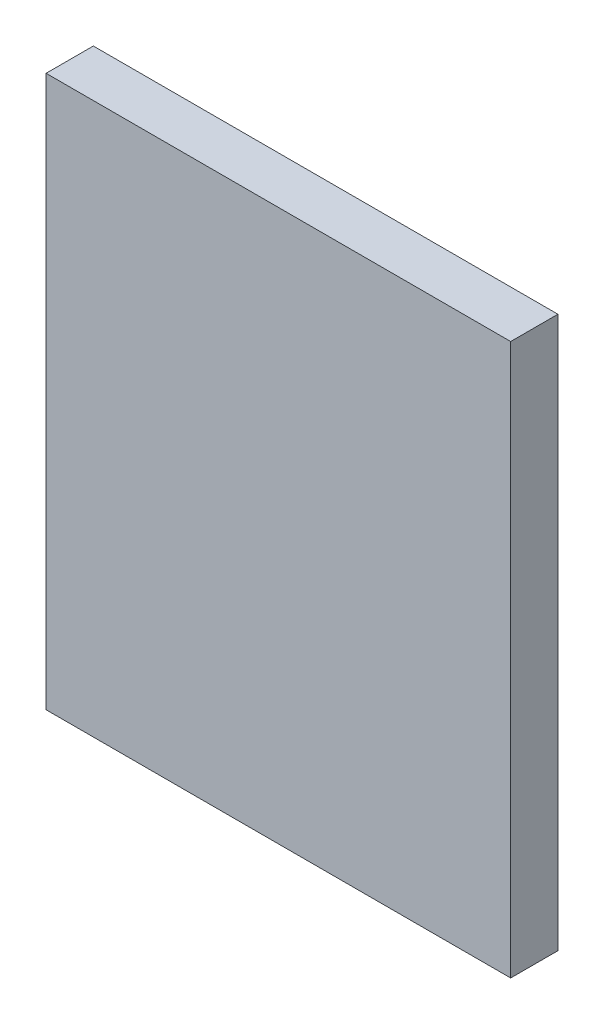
ISO-10303-21;
HEADER;
FILE_DESCRIPTION(('STEP AP214'),'2;1');
FILE_NAME('part.step','',(''),(''),'','','');
FILE_SCHEMA(('AUTOMOTIVE_DESIGN { 1 0 10303 214 1 1 1 1 }'));
ENDSEC;
DATA;
#1=APPLICATION_CONTEXT('core data for automotive mechanical design processes');
#2=APPLICATION_PROTOCOL_DEFINITION('international standard','automotive_design',2000,#1);
#3=PRODUCT_CONTEXT('',#1,'mechanical');
#4=PRODUCT('Part','Part','',(#3));
#5=PRODUCT_RELATED_PRODUCT_CATEGORY('part','',(#4));
#6=PRODUCT_DEFINITION_FORMATION('','',#4);
#7=PRODUCT_DEFINITION_CONTEXT('part definition',#1,'design');
#8=PRODUCT_DEFINITION('design','',#6,#7);
#9=PRODUCT_DEFINITION_SHAPE('','',#8);
#10=(LENGTH_UNIT() NAMED_UNIT(*) SI_UNIT(.MILLI.,.METRE.));
#11=(NAMED_UNIT(*) PLANE_ANGLE_UNIT() SI_UNIT($,.RADIAN.));
#12=(NAMED_UNIT(*) SI_UNIT($,.STERADIAN.) SOLID_ANGLE_UNIT());
#13=UNCERTAINTY_MEASURE_WITH_UNIT(LENGTH_MEASURE(1.E-05),#10,'distance_accuracy_value','');
#14=(GEOMETRIC_REPRESENTATION_CONTEXT(3) GLOBAL_UNCERTAINTY_ASSIGNED_CONTEXT((#13)) GLOBAL_UNIT_ASSIGNED_CONTEXT((#10,
#11,#12)) REPRESENTATION_CONTEXT('',''));
#15=CARTESIAN_POINT('',(0.,0.,0.));
#16=DIRECTION('',(0.,0.,1.));
#17=DIRECTION('',(1.,0.,0.));
#18=AXIS2_PLACEMENT_3D('',#15,#16,#17);
#19=CARTESIAN_POINT('',(14.75,17.5,3.));
#20=DIRECTION('',(-1.,0.,0.));
#21=DIRECTION('',(0.,-1.,0.));
#22=AXIS2_PLACEMENT_3D('',#19,#20,#21);
#23=PLANE('',#22);
#24=DIRECTION('',(0.,1.,0.));
#25=VECTOR('',#24,1.);
#26=CARTESIAN_POINT('',(14.75,17.5,0.));
#27=LINE('',#26,#25);
#28=CARTESIAN_POINT('',(14.75,-17.5,0.));
#29=VERTEX_POINT('',#28);
#30=CARTESIAN_POINT('',(14.75,17.5,0.));
#31=VERTEX_POINT('',#30);
#32=EDGE_CURVE('E96',#29,#31,#27,.T.);
#33=ORIENTED_EDGE('',*,*,#32,.T.);
#34=DIRECTION('',(0.,0.,-1.));
#35=VECTOR('',#34,1.);
#36=CARTESIAN_POINT('',(14.75,17.5,3.));
#37=LINE('',#36,#35);
#38=CARTESIAN_POINT('',(14.75,17.5,3.));
#39=VERTEX_POINT('',#38);
#40=EDGE_CURVE('E11',#39,#31,#37,.T.);
#41=ORIENTED_EDGE('',*,*,#40,.F.);
#42=DIRECTION('',(0.,1.,0.));
#43=VECTOR('',#42,1.);
#44=CARTESIAN_POINT('',(14.75,17.5,3.));
#45=LINE('',#44,#43);
#46=CARTESIAN_POINT('',(14.75,-17.5,3.));
#47=VERTEX_POINT('',#46);
#48=EDGE_CURVE('E84',#47,#39,#45,.T.);
#49=ORIENTED_EDGE('',*,*,#48,.F.);
#50=DIRECTION('',(0.,0.,-1.));
#51=VECTOR('',#50,1.);
#52=CARTESIAN_POINT('',(14.75,-17.5,3.));
#53=LINE('',#52,#51);
#54=EDGE_CURVE('E92',#47,#29,#53,.T.);
#55=ORIENTED_EDGE('',*,*,#54,.T.);
#56=EDGE_LOOP('',(#33,#41,#49,#55));
#57=FACE_BOUND('',#56,.T.);
#58=ADVANCED_FACE('F33',(#57),#23,.F.);
#59=CARTESIAN_POINT('',(-14.75,17.5,3.));
#60=DIRECTION('',(0.,-1.,0.));
#61=DIRECTION('',(0.,0.,-1.));
#62=AXIS2_PLACEMENT_3D('',#59,#60,#61);
#63=PLANE('',#62);
#64=DIRECTION('',(-1.,0.,0.));
#65=VECTOR('',#64,1.);
#66=CARTESIAN_POINT('',(-14.75,17.5,0.));
#67=LINE('',#66,#65);
#68=CARTESIAN_POINT('',(-14.75,17.5,0.));
#69=VERTEX_POINT('',#68);
#70=EDGE_CURVE('E88',#31,#69,#67,.T.);
#71=ORIENTED_EDGE('',*,*,#70,.T.);
#72=DIRECTION('',(0.,0.,-1.));
#73=VECTOR('',#72,1.);
#74=CARTESIAN_POINT('',(-14.75,17.5,3.));
#75=LINE('',#74,#73);
#76=CARTESIAN_POINT('',(-14.75,17.5,3.));
#77=VERTEX_POINT('',#76);
#78=EDGE_CURVE('E41',#77,#69,#75,.T.);
#79=ORIENTED_EDGE('',*,*,#78,.F.);
#80=DIRECTION('',(-1.,0.,0.));
#81=VECTOR('',#80,1.);
#82=CARTESIAN_POINT('',(-14.75,17.5,3.));
#83=LINE('',#82,#81);
#84=EDGE_CURVE('E79',#39,#77,#83,.T.);
#85=ORIENTED_EDGE('',*,*,#84,.F.);
#86=ORIENTED_EDGE('',*,*,#40,.T.);
#87=EDGE_LOOP('',(#71,#79,#85,#86));
#88=FACE_BOUND('',#87,.T.);
#89=ADVANCED_FACE('F87',(#88),#63,.F.);
#90=CARTESIAN_POINT('',(-14.75,17.5,3.));
#91=DIRECTION('',(1.,0.,0.));
#92=DIRECTION('',(0.,1.,0.));
#93=AXIS2_PLACEMENT_3D('',#90,#91,#92);
#94=PLANE('',#93);
#95=DIRECTION('',(0.,-1.,0.));
#96=VECTOR('',#95,1.);
#97=CARTESIAN_POINT('',(-14.75,17.5,0.));
#98=LINE('',#97,#96);
#99=CARTESIAN_POINT('',(-14.75,-17.5,0.));
#100=VERTEX_POINT('',#99);
#101=EDGE_CURVE('E66',#69,#100,#98,.T.);
#102=ORIENTED_EDGE('',*,*,#101,.T.);
#103=DIRECTION('',(0.,0.,-1.));
#104=VECTOR('',#103,1.);
#105=CARTESIAN_POINT('',(-14.75,-17.5,3.));
#106=LINE('',#105,#104);
#107=CARTESIAN_POINT('',(-14.75,-17.5,3.));
#108=VERTEX_POINT('',#107);
#109=EDGE_CURVE('E89',#108,#100,#106,.T.);
#110=ORIENTED_EDGE('',*,*,#109,.F.);
#111=DIRECTION('',(0.,-1.,0.));
#112=VECTOR('',#111,1.);
#113=CARTESIAN_POINT('',(-14.75,17.5,3.));
#114=LINE('',#113,#112);
#115=EDGE_CURVE('E82',#77,#108,#114,.T.);
#116=ORIENTED_EDGE('',*,*,#115,.F.);
#117=ORIENTED_EDGE('',*,*,#78,.T.);
#118=EDGE_LOOP('',(#102,#110,#116,#117));
#119=FACE_BOUND('',#118,.T.);
#120=ADVANCED_FACE('F90',(#119),#94,.F.);
#121=CARTESIAN_POINT('',(-14.75,-17.5,3.));
#122=DIRECTION('',(0.,1.,0.));
#123=DIRECTION('',(0.,0.,1.));
#124=AXIS2_PLACEMENT_3D('',#121,#122,#123);
#125=PLANE('',#124);
#126=DIRECTION('',(1.,0.,0.));
#127=VECTOR('',#126,1.);
#128=CARTESIAN_POINT('',(-14.75,-17.5,0.));
#129=LINE('',#128,#127);
#130=EDGE_CURVE('E72',#100,#29,#129,.T.);
#131=ORIENTED_EDGE('',*,*,#130,.T.);
#132=ORIENTED_EDGE('',*,*,#54,.F.);
#133=DIRECTION('',(1.,0.,0.));
#134=VECTOR('',#133,1.);
#135=CARTESIAN_POINT('',(-14.75,-17.5,3.));
#136=LINE('',#135,#134);
#137=EDGE_CURVE('E49',#108,#47,#136,.T.);
#138=ORIENTED_EDGE('',*,*,#137,.F.);
#139=ORIENTED_EDGE('',*,*,#109,.T.);
#140=EDGE_LOOP('',(#131,#132,#138,#139));
#141=FACE_BOUND('',#140,.T.);
#142=ADVANCED_FACE('F103',(#141),#125,.F.);
#143=CARTESIAN_POINT('',(0.,0.,3.));
#144=DIRECTION('',(0.,0.,1.));
#145=DIRECTION('',(1.,0.,0.));
#146=AXIS2_PLACEMENT_3D('',#143,#144,#145);
#147=PLANE('',#146);
#148=ORIENTED_EDGE('',*,*,#48,.T.);
#149=ORIENTED_EDGE('',*,*,#84,.T.);
#150=ORIENTED_EDGE('',*,*,#115,.T.);
#151=ORIENTED_EDGE('',*,*,#137,.T.);
#152=EDGE_LOOP('',(#148,#149,#150,#151));
#153=FACE_BOUND('',#152,.T.);
#154=ADVANCED_FACE('F80',(#153),#147,.T.);
#155=CARTESIAN_POINT('',(0.,0.,0.));
#156=DIRECTION('',(0.,0.,1.));
#157=DIRECTION('',(1.,0.,0.));
#158=AXIS2_PLACEMENT_3D('',#155,#156,#157);
#159=PLANE('',#158);
#160=ORIENTED_EDGE('',*,*,#32,.F.);
#161=ORIENTED_EDGE('',*,*,#130,.F.);
#162=ORIENTED_EDGE('',*,*,#101,.F.);
#163=ORIENTED_EDGE('',*,*,#70,.F.);
#164=EDGE_LOOP('',(#160,#161,#162,#163));
#165=FACE_BOUND('',#164,.T.);
#166=ADVANCED_FACE('F106',(#165),#159,.F.);
#167=CLOSED_SHELL('',(#58,#89,#120,#142,#154,#166));
#168=MANIFOLD_SOLID_BREP('B2',#167);
#169=ADVANCED_BREP_SHAPE_REPRESENTATION('',(#18,#168),#14);
#170=SHAPE_DEFINITION_REPRESENTATION(#9,#169);
ENDSEC;
END-ISO-10303-21;
